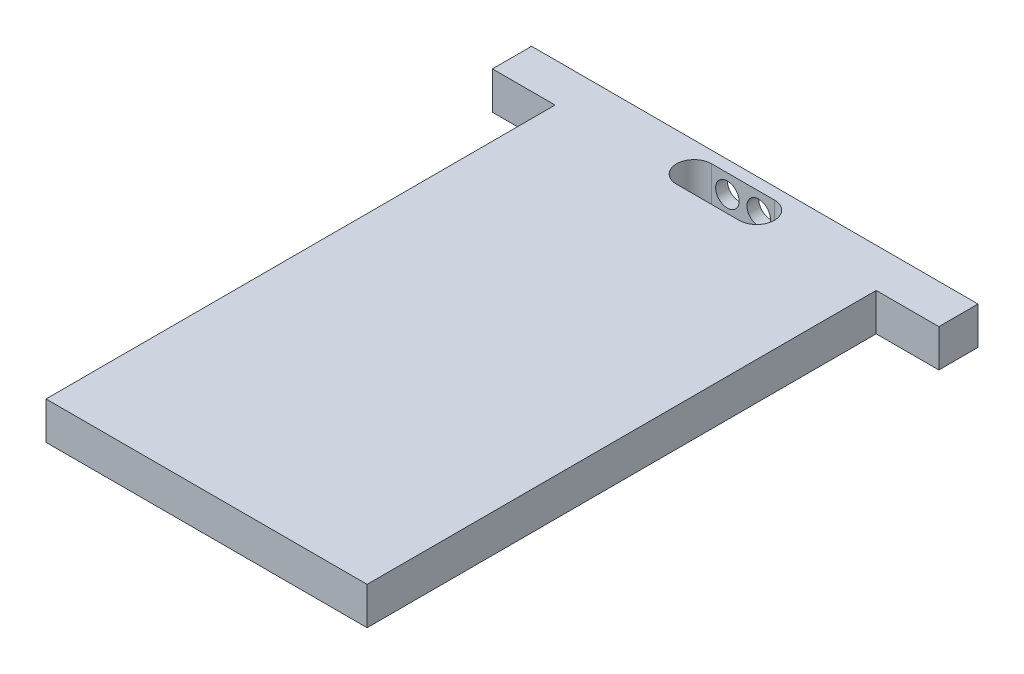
from build123d import *

# Parameters (mm, degrees)
SKETCH1_W           = 41
SKETCH1_H           = 4.8
BOSS_EXTRUDE1_DEPTH = 32.5
SKETCH2_W           = 57
SKETCH2_H           = 4.8
BOSS_EXTRUDE2_DEPTH = 5
CUT_EXTRUDE1_DEPTH  = 48.344904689
CUT_EXTRUDE2_REACH  = 77.618
SKETCH4_R           = 1.5


with BuildPart() as part:
    # Sketch1 → Boss-Extrude1 (new, symmetric)
    with BuildSketch(Plane.XY):
        Rectangle(SKETCH1_W, SKETCH1_H)
    extrude(amount=BOSS_EXTRUDE1_DEPTH, both=True)

    # Sketch2 → Boss-Extrude2 (add)
    with BuildSketch(Plane.XY.offset(-32.5)):
        Rectangle(SKETCH2_W, SKETCH2_H)
    extrude(amount=-BOSS_EXTRUDE2_DEPTH)

    # Sketch3 → Cut-Extrude1 (cut, through all)
    with BuildSketch(Plane(origin=(0, 2.4, 0), x_dir=(1, 0, 0), z_dir=(0, 1, 0))):
        with BuildLine():
            Line((-4, 36), (4, 36))
            ThreePointArc((4, 36), (6.25, 33.75), (4, 31.5))
            Line((4, 31.5), (-4, 31.5))
            ThreePointArc((-4, 31.5), (-6.25, 33.75), (-4, 36))
        make_face()
    extrude(amount=-CUT_EXTRUDE1_DEPTH, mode=Mode.SUBTRACT)

    # Sketch4 → Cut-Extrude2 (cut, up to next)
    with BuildSketch(Plane(origin=(0, 0, -37.5), x_dir=(-1, 0, 0), z_dir=(0, 0, -1)), mode=Mode.PRIVATE) as cut_extrude2_sk1:
        with Locations((2, 0)):
            Circle(SKETCH4_R)
    cut_extrude2_tool1 = extrude(cut_extrude2_sk1.sketch, amount=-CUT_EXTRUDE2_REACH, mode=Mode.PRIVATE) & part.part
    # Sketch4 → Cut-Extrude2 (cut, up to next)
    with BuildSketch(Plane(origin=(0, 0, -37.5), x_dir=(-1, 0, 0), z_dir=(0, 0, -1)), mode=Mode.PRIVATE) as cut_extrude2_sk2:
        with Locations((-2, 0)):
            Circle(SKETCH4_R)
    cut_extrude2_tool2 = extrude(cut_extrude2_sk2.sketch, amount=-CUT_EXTRUDE2_REACH, mode=Mode.PRIVATE) & part.part
    add(cut_extrude2_tool1.solids().sort_by_distance((-2, 0, -37.5))[0], mode=Mode.SUBTRACT)
    add(cut_extrude2_tool2.solids().sort_by_distance((2, 0, -37.5))[0], mode=Mode.SUBTRACT)


solid = part.part
